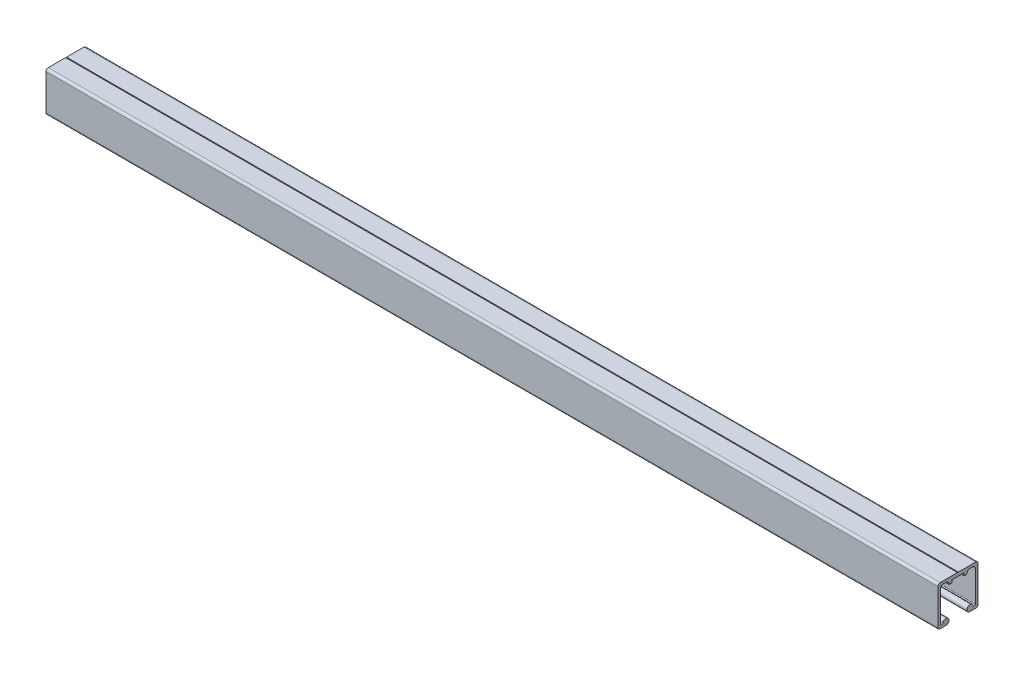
ISO-10303-21;
HEADER;
FILE_DESCRIPTION(('STEP AP214'),'2;1');
FILE_NAME('part.step','',(''),(''),'','','');
FILE_SCHEMA(('AUTOMOTIVE_DESIGN { 1 0 10303 214 1 1 1 1 }'));
ENDSEC;
DATA;
#1=APPLICATION_CONTEXT('core data for automotive mechanical design processes');
#2=APPLICATION_PROTOCOL_DEFINITION('international standard','automotive_design',2000,#1);
#3=PRODUCT_CONTEXT('',#1,'mechanical');
#4=PRODUCT('Part','Part','',(#3));
#5=PRODUCT_RELATED_PRODUCT_CATEGORY('part','',(#4));
#6=PRODUCT_DEFINITION_FORMATION('','',#4);
#7=PRODUCT_DEFINITION_CONTEXT('part definition',#1,'design');
#8=PRODUCT_DEFINITION('design','',#6,#7);
#9=PRODUCT_DEFINITION_SHAPE('','',#8);
#10=(LENGTH_UNIT() NAMED_UNIT(*) SI_UNIT(.MILLI.,.METRE.));
#11=(NAMED_UNIT(*) PLANE_ANGLE_UNIT() SI_UNIT($,.RADIAN.));
#12=(NAMED_UNIT(*) SI_UNIT($,.STERADIAN.) SOLID_ANGLE_UNIT());
#13=UNCERTAINTY_MEASURE_WITH_UNIT(LENGTH_MEASURE(1.E-05),#10,'distance_accuracy_value','');
#14=(GEOMETRIC_REPRESENTATION_CONTEXT(3) GLOBAL_UNCERTAINTY_ASSIGNED_CONTEXT((#13)) GLOBAL_UNIT_ASSIGNED_CONTEXT((#10,
#11,#12)) REPRESENTATION_CONTEXT('',''));
#15=CARTESIAN_POINT('',(0.,0.,0.));
#16=DIRECTION('',(0.,0.,1.));
#17=DIRECTION('',(1.,0.,0.));
#18=AXIS2_PLACEMENT_3D('',#15,#16,#17);
#19=CARTESIAN_POINT('',(1000.,16.5663300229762,-16.5000000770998));
#20=DIRECTION('',(-1.,0.,0.));
#21=DIRECTION('',(0.,0.,1.));
#22=AXIS2_PLACEMENT_3D('',#19,#20,#21);
#23=CYLINDRICAL_SURFACE('',#22,2.99999999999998);
#24=CARTESIAN_POINT('',(0.,16.5663300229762,-16.5000000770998));
#25=DIRECTION('',(-1.,0.,0.));
#26=DIRECTION('',(0.,0.,-1.));
#27=AXIS2_PLACEMENT_3D('',#24,#25,#26);
#28=CIRCLE('',#27,2.99999999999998);
#29=CARTESIAN_POINT('',(0.,19.5663300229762,-16.5000000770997));
#30=VERTEX_POINT('',#29);
#31=CARTESIAN_POINT('',(0.,16.5663300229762,-19.5000000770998));
#32=VERTEX_POINT('',#31);
#33=EDGE_CURVE('E419',#30,#32,#28,.T.);
#34=ORIENTED_EDGE('',*,*,#33,.T.);
#35=DIRECTION('',(-1.,0.,0.));
#36=VECTOR('',#35,1.);
#37=CARTESIAN_POINT('',(1000.,16.5663300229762,-19.5000000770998));
#38=LINE('',#37,#36);
#39=CARTESIAN_POINT('',(1000.,16.5663300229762,-19.5000000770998));
#40=VERTEX_POINT('',#39);
#41=EDGE_CURVE('E12',#40,#32,#38,.T.);
#42=ORIENTED_EDGE('',*,*,#41,.F.);
#43=CARTESIAN_POINT('',(1000.,16.5663300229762,-16.5000000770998));
#44=DIRECTION('',(-1.,0.,0.));
#45=DIRECTION('',(0.,0.,-1.));
#46=AXIS2_PLACEMENT_3D('',#43,#44,#45);
#47=CIRCLE('',#46,2.99999999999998);
#48=CARTESIAN_POINT('',(1000.,19.5663300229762,-16.5000000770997));
#49=VERTEX_POINT('',#48);
#50=EDGE_CURVE('E522',#49,#40,#47,.T.);
#51=ORIENTED_EDGE('',*,*,#50,.F.);
#52=DIRECTION('',(-1.,0.,0.));
#53=VECTOR('',#52,1.);
#54=CARTESIAN_POINT('',(1000.,19.5663300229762,-16.5000000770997));
#55=LINE('',#54,#53);
#56=EDGE_CURVE('E415',#49,#30,#55,.T.);
#57=ORIENTED_EDGE('',*,*,#56,.T.);
#58=EDGE_LOOP('',(#34,#42,#51,#57));
#59=FACE_BOUND('',#58,.T.);
#60=ADVANCED_FACE('F156',(#59),#23,.F.);
#61=CARTESIAN_POINT('',(1000.,16.5663300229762,-19.5000000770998));
#62=DIRECTION('',(0.,0.,-1.));
#63=DIRECTION('',(0.,1.,0.));
#64=AXIS2_PLACEMENT_3D('',#61,#62,#63);
#65=PLANE('',#64);
#66=DIRECTION('',(0.,-1.,0.));
#67=VECTOR('',#66,1.);
#68=CARTESIAN_POINT('',(0.,16.5663300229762,-19.5000000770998));
#69=LINE('',#68,#67);
#70=CARTESIAN_POINT('',(0.,-18.1836699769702,-19.5000000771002));
#71=VERTEX_POINT('',#70);
#72=EDGE_CURVE('E423',#32,#71,#69,.T.);
#73=ORIENTED_EDGE('',*,*,#72,.T.);
#74=DIRECTION('',(-1.,0.,0.));
#75=VECTOR('',#74,1.);
#76=CARTESIAN_POINT('',(1000.,-18.1836699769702,-19.5000000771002));
#77=LINE('',#76,#75);
#78=CARTESIAN_POINT('',(1000.,-18.1836699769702,-19.5000000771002));
#79=VERTEX_POINT('',#78);
#80=EDGE_CURVE('E165',#79,#71,#77,.T.);
#81=ORIENTED_EDGE('',*,*,#80,.F.);
#82=DIRECTION('',(0.,-1.,0.));
#83=VECTOR('',#82,1.);
#84=CARTESIAN_POINT('',(1000.,16.5663300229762,-19.5000000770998));
#85=LINE('',#84,#83);
#86=EDGE_CURVE('E297',#40,#79,#85,.T.);
#87=ORIENTED_EDGE('',*,*,#86,.F.);
#88=ORIENTED_EDGE('',*,*,#41,.T.);
#89=EDGE_LOOP('',(#73,#81,#87,#88));
#90=FACE_BOUND('',#89,.T.);
#91=ADVANCED_FACE('F777',(#90),#65,.F.);
#92=CARTESIAN_POINT('',(1000.,-18.1836699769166,-18.2500000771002));
#93=DIRECTION('',(-1.,0.,0.));
#94=DIRECTION('',(0.,0.,1.));
#95=AXIS2_PLACEMENT_3D('',#92,#93,#94);
#96=CYLINDRICAL_SURFACE('',#95,1.25000000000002);
#97=CARTESIAN_POINT('',(0.,-18.1836699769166,-18.2500000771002));
#98=DIRECTION('',(-1.,0.,0.));
#99=DIRECTION('',(0.,0.,-1.));
#100=AXIS2_PLACEMENT_3D('',#97,#98,#99);
#101=CIRCLE('',#100,1.25000000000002);
#102=CARTESIAN_POINT('',(0.,-18.5688052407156,-17.0608109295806));
#103=VERTEX_POINT('',#102);
#104=EDGE_CURVE('E426',#71,#103,#101,.T.);
#105=ORIENTED_EDGE('',*,*,#104,.T.);
#106=DIRECTION('',(-1.,0.,0.));
#107=VECTOR('',#106,1.);
#108=CARTESIAN_POINT('',(1000.,-18.5688052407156,-17.0608109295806));
#109=LINE('',#108,#107);
#110=CARTESIAN_POINT('',(1000.,-18.5688052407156,-17.0608109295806));
#111=VERTEX_POINT('',#110);
#112=EDGE_CURVE('E641',#111,#103,#109,.T.);
#113=ORIENTED_EDGE('',*,*,#112,.F.);
#114=CARTESIAN_POINT('',(1000.,-18.1836699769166,-18.2500000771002));
#115=DIRECTION('',(-1.,0.,0.));
#116=DIRECTION('',(0.,0.,-1.));
#117=AXIS2_PLACEMENT_3D('',#114,#115,#116);
#118=CIRCLE('',#117,1.25000000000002);
#119=EDGE_CURVE('E651',#79,#111,#118,.T.);
#120=ORIENTED_EDGE('',*,*,#119,.F.);
#121=ORIENTED_EDGE('',*,*,#80,.T.);
#122=EDGE_LOOP('',(#105,#113,#120,#121));
#123=FACE_BOUND('',#122,.T.);
#124=ADVANCED_FACE('F649',(#123),#96,.F.);
#125=CARTESIAN_POINT('',(1000.,-18.5688052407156,-17.0608109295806));
#126=DIRECTION('',(0.,-0.308108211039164,0.951351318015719));
#127=DIRECTION('',(0.,-0.951351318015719,-0.308108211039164));
#128=AXIS2_PLACEMENT_3D('',#125,#126,#127);
#129=PLANE('',#128);
#130=DIRECTION('',(0.,0.951351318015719,0.308108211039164));
#131=VECTOR('',#130,1.);
#132=CARTESIAN_POINT('',(0.,-18.5688052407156,-17.0608109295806));
#133=LINE('',#132,#131);
#134=CARTESIAN_POINT('',(0.,-17.8552912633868,-16.8297296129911));
#135=VERTEX_POINT('',#134);
#136=EDGE_CURVE('E429',#103,#135,#133,.T.);
#137=ORIENTED_EDGE('',*,*,#136,.T.);
#138=DIRECTION('',(-1.,0.,0.));
#139=VECTOR('',#138,1.);
#140=CARTESIAN_POINT('',(1000.,-17.8552912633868,-16.8297296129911));
#141=LINE('',#140,#139);
#142=CARTESIAN_POINT('',(1000.,-17.8552912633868,-16.8297296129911));
#143=VERTEX_POINT('',#142);
#144=EDGE_CURVE('E637',#143,#135,#141,.T.);
#145=ORIENTED_EDGE('',*,*,#144,.F.);
#146=DIRECTION('',(0.,0.951351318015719,0.308108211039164));
#147=VECTOR('',#146,1.);
#148=CARTESIAN_POINT('',(1000.,-18.5688052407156,-17.0608109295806));
#149=LINE('',#148,#147);
#150=EDGE_CURVE('E670',#111,#143,#149,.T.);
#151=ORIENTED_EDGE('',*,*,#150,.F.);
#152=ORIENTED_EDGE('',*,*,#112,.T.);
#153=EDGE_LOOP('',(#137,#145,#151,#152));
#154=FACE_BOUND('',#153,.T.);
#155=ADVANCED_FACE('F660',(#154),#129,.F.);
#156=CARTESIAN_POINT('',(1000.,-18.9336700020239,-13.499999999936));
#157=DIRECTION('',(-1.,0.,0.));
#158=DIRECTION('',(0.,0.,1.));
#159=AXIS2_PLACEMENT_3D('',#156,#157,#158);
#160=CYLINDRICAL_SURFACE('',#159,3.50000000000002);
#161=CARTESIAN_POINT('',(0.,-18.9336700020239,-13.499999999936));
#162=DIRECTION('',(1.,0.,0.));
#163=DIRECTION('',(0.,0.,-1.));
#164=AXIS2_PLACEMENT_3D('',#161,#162,#163);
#165=CIRCLE('',#164,3.50000000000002);
#166=CARTESIAN_POINT('',(0.,-22.4336700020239,-13.4999999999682));
#167=VERTEX_POINT('',#166);
#168=EDGE_CURVE('E432',#135,#167,#165,.T.);
#169=ORIENTED_EDGE('',*,*,#168,.T.);
#170=DIRECTION('',(-1.,0.,0.));
#171=VECTOR('',#170,1.);
#172=CARTESIAN_POINT('',(1000.,-22.4336700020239,-13.4999999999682));
#173=LINE('',#172,#171);
#174=CARTESIAN_POINT('',(1000.,-22.4336700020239,-13.4999999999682));
#175=VERTEX_POINT('',#174);
#176=EDGE_CURVE('E633',#175,#167,#173,.T.);
#177=ORIENTED_EDGE('',*,*,#176,.F.);
#178=CARTESIAN_POINT('',(1000.,-18.9336700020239,-13.499999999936));
#179=DIRECTION('',(1.,0.,0.));
#180=DIRECTION('',(0.,0.,-1.));
#181=AXIS2_PLACEMENT_3D('',#178,#179,#180);
#182=CIRCLE('',#181,3.50000000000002);
#183=EDGE_CURVE('E666',#143,#175,#182,.T.);
#184=ORIENTED_EDGE('',*,*,#183,.F.);
#185=ORIENTED_EDGE('',*,*,#144,.T.);
#186=EDGE_LOOP('',(#169,#177,#184,#185));
#187=FACE_BOUND('',#186,.T.);
#188=ADVANCED_FACE('F664',(#187),#160,.T.);
#189=CARTESIAN_POINT('',(1000.,-22.4336700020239,-13.4999999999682));
#190=DIRECTION('',(0.,1.,0.));
#191=DIRECTION('',(0.,0.,1.));
#192=AXIS2_PLACEMENT_3D('',#189,#190,#191);
#193=PLANE('',#192);
#194=DIRECTION('',(0.,0.,-1.));
#195=VECTOR('',#194,1.);
#196=CARTESIAN_POINT('',(0.,-22.4336700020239,-13.4999999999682));
#197=LINE('',#196,#195);
#198=CARTESIAN_POINT('',(0.,-22.4336700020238,-20.0000000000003));
#199=VERTEX_POINT('',#198);
#200=EDGE_CURVE('E435',#167,#199,#197,.T.);
#201=ORIENTED_EDGE('',*,*,#200,.T.);
#202=DIRECTION('',(-1.,0.,0.));
#203=VECTOR('',#202,1.);
#204=CARTESIAN_POINT('',(1000.,-22.4336700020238,-20.0000000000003));
#205=LINE('',#204,#203);
#206=CARTESIAN_POINT('',(1000.,-22.4336700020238,-20.0000000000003));
#207=VERTEX_POINT('',#206);
#208=EDGE_CURVE('E629',#207,#199,#205,.T.);
#209=ORIENTED_EDGE('',*,*,#208,.F.);
#210=DIRECTION('',(0.,0.,-1.));
#211=VECTOR('',#210,1.);
#212=CARTESIAN_POINT('',(1000.,-22.4336700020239,-13.4999999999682));
#213=LINE('',#212,#211);
#214=EDGE_CURVE('E669',#175,#207,#213,.T.);
#215=ORIENTED_EDGE('',*,*,#214,.F.);
#216=ORIENTED_EDGE('',*,*,#176,.T.);
#217=EDGE_LOOP('',(#201,#209,#215,#216));
#218=FACE_BOUND('',#217,.T.);
#219=ADVANCED_FACE('F790',(#218),#193,.F.);
#220=CARTESIAN_POINT('',(1000.,-19.9336700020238,-20.0000000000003));
#221=DIRECTION('',(-1.,0.,0.));
#222=DIRECTION('',(0.,0.,1.));
#223=AXIS2_PLACEMENT_3D('',#220,#221,#222);
#224=CYLINDRICAL_SURFACE('',#223,2.50000000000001);
#225=CARTESIAN_POINT('',(0.,-19.9336700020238,-20.0000000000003));
#226=DIRECTION('',(1.,0.,0.));
#227=DIRECTION('',(0.,0.,-1.));
#228=AXIS2_PLACEMENT_3D('',#225,#226,#227);
#229=CIRCLE('',#228,2.50000000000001);
#230=CARTESIAN_POINT('',(0.,-19.9336700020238,-22.5000000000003));
#231=VERTEX_POINT('',#230);
#232=EDGE_CURVE('E438',#199,#231,#229,.T.);
#233=ORIENTED_EDGE('',*,*,#232,.T.);
#234=DIRECTION('',(-1.,0.,0.));
#235=VECTOR('',#234,1.);
#236=CARTESIAN_POINT('',(1000.,-19.9336700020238,-22.5000000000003));
#237=LINE('',#236,#235);
#238=CARTESIAN_POINT('',(1000.,-19.9336700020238,-22.5000000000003));
#239=VERTEX_POINT('',#238);
#240=EDGE_CURVE('E625',#239,#231,#237,.T.);
#241=ORIENTED_EDGE('',*,*,#240,.F.);
#242=CARTESIAN_POINT('',(1000.,-19.9336700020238,-20.0000000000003));
#243=DIRECTION('',(1.,0.,0.));
#244=DIRECTION('',(0.,0.,-1.));
#245=AXIS2_PLACEMENT_3D('',#242,#243,#244);
#246=CIRCLE('',#245,2.50000000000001);
#247=EDGE_CURVE('E674',#207,#239,#246,.T.);
#248=ORIENTED_EDGE('',*,*,#247,.F.);
#249=ORIENTED_EDGE('',*,*,#208,.T.);
#250=EDGE_LOOP('',(#233,#241,#248,#249));
#251=FACE_BOUND('',#250,.T.);
#252=ADVANCED_FACE('F793',(#251),#224,.T.);
#253=CARTESIAN_POINT('',(1000.,-19.9336700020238,-22.5000000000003));
#254=DIRECTION('',(0.,0.,1.));
#255=DIRECTION('',(0.,-1.,0.));
#256=AXIS2_PLACEMENT_3D('',#253,#254,#255);
#257=PLANE('',#256);
#258=DIRECTION('',(0.,1.,0.));
#259=VECTOR('',#258,1.);
#260=CARTESIAN_POINT('',(0.,-19.9336700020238,-22.5000000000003));
#261=LINE('',#260,#259);
#262=CARTESIAN_POINT('',(0.,20.0663299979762,-22.4999999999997));
#263=VERTEX_POINT('',#262);
#264=EDGE_CURVE('E441',#231,#263,#261,.T.);
#265=ORIENTED_EDGE('',*,*,#264,.T.);
#266=DIRECTION('',(-1.,0.,0.));
#267=VECTOR('',#266,1.);
#268=CARTESIAN_POINT('',(1000.,20.0663299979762,-22.4999999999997));
#269=LINE('',#268,#267);
#270=CARTESIAN_POINT('',(1000.,20.0663299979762,-22.4999999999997));
#271=VERTEX_POINT('',#270);
#272=EDGE_CURVE('E621',#271,#263,#269,.T.);
#273=ORIENTED_EDGE('',*,*,#272,.F.);
#274=DIRECTION('',(0.,1.,0.));
#275=VECTOR('',#274,1.);
#276=CARTESIAN_POINT('',(1000.,-19.9336700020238,-22.5000000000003));
#277=LINE('',#276,#275);
#278=EDGE_CURVE('E681',#239,#271,#277,.T.);
#279=ORIENTED_EDGE('',*,*,#278,.F.);
#280=ORIENTED_EDGE('',*,*,#240,.T.);
#281=EDGE_LOOP('',(#265,#273,#279,#280));
#282=FACE_BOUND('',#281,.T.);
#283=ADVANCED_FACE('F797',(#282),#257,.F.);
#284=CARTESIAN_POINT('',(1000.,20.0663299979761,-19.9999999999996));
#285=DIRECTION('',(-1.,0.,0.));
#286=DIRECTION('',(0.,0.,1.));
#287=AXIS2_PLACEMENT_3D('',#284,#285,#286);
#288=CYLINDRICAL_SURFACE('',#287,2.50000000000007);
#289=CARTESIAN_POINT('',(0.,20.0663299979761,-19.9999999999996));
#290=DIRECTION('',(1.,0.,0.));
#291=DIRECTION('',(0.,0.,-1.));
#292=AXIS2_PLACEMENT_3D('',#289,#290,#291);
#293=CIRCLE('',#292,2.50000000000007);
#294=CARTESIAN_POINT('',(0.,22.5663299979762,-19.9999999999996));
#295=VERTEX_POINT('',#294);
#296=EDGE_CURVE('E444',#263,#295,#293,.T.);
#297=ORIENTED_EDGE('',*,*,#296,.T.);
#298=DIRECTION('',(-1.,0.,0.));
#299=VECTOR('',#298,1.);
#300=CARTESIAN_POINT('',(1000.,22.5663299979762,-19.9999999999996));
#301=LINE('',#300,#299);
#302=CARTESIAN_POINT('',(1000.,22.5663299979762,-19.9999999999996));
#303=VERTEX_POINT('',#302);
#304=EDGE_CURVE('E617',#303,#295,#301,.T.);
#305=ORIENTED_EDGE('',*,*,#304,.F.);
#306=CARTESIAN_POINT('',(1000.,20.0663299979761,-19.9999999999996));
#307=DIRECTION('',(1.,0.,0.));
#308=DIRECTION('',(0.,0.,-1.));
#309=AXIS2_PLACEMENT_3D('',#306,#307,#308);
#310=CIRCLE('',#309,2.50000000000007);
#311=EDGE_CURVE('E684',#271,#303,#310,.T.);
#312=ORIENTED_EDGE('',*,*,#311,.F.);
#313=ORIENTED_EDGE('',*,*,#272,.T.);
#314=EDGE_LOOP('',(#297,#305,#312,#313));
#315=FACE_BOUND('',#314,.T.);
#316=ADVANCED_FACE('F801',(#315),#288,.T.);
#317=CARTESIAN_POINT('',(1000.,22.5663299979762,-19.9999999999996));
#318=DIRECTION('',(0.,-1.,0.));
#319=DIRECTION('',(0.,0.,-1.));
#320=AXIS2_PLACEMENT_3D('',#317,#318,#319);
#321=PLANE('',#320);
#322=DIRECTION('',(0.,0.,1.));
#323=VECTOR('',#322,1.);
#324=CARTESIAN_POINT('',(0.,22.5663299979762,-19.9999999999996));
#325=LINE('',#324,#323);
#326=CARTESIAN_POINT('',(0.,22.5663299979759,-0.500000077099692));
#327=VERTEX_POINT('',#326);
#328=EDGE_CURVE('E447',#295,#327,#325,.T.);
#329=ORIENTED_EDGE('',*,*,#328,.T.);
#330=DIRECTION('',(-1.,0.,0.));
#331=VECTOR('',#330,1.);
#332=CARTESIAN_POINT('',(1000.,22.5663299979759,-0.500000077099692));
#333=LINE('',#332,#331);
#334=CARTESIAN_POINT('',(1000.,22.5663299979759,-0.500000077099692));
#335=VERTEX_POINT('',#334);
#336=EDGE_CURVE('E613',#335,#327,#333,.T.);
#337=ORIENTED_EDGE('',*,*,#336,.F.);
#338=DIRECTION('',(0.,0.,1.));
#339=VECTOR('',#338,1.);
#340=CARTESIAN_POINT('',(1000.,22.5663299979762,-19.9999999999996));
#341=LINE('',#340,#339);
#342=EDGE_CURVE('E687',#303,#335,#341,.T.);
#343=ORIENTED_EDGE('',*,*,#342,.F.);
#344=ORIENTED_EDGE('',*,*,#304,.T.);
#345=EDGE_LOOP('',(#329,#337,#343,#344));
#346=FACE_BOUND('',#345,.T.);
#347=ADVANCED_FACE('F805',(#346),#321,.F.);
#348=CARTESIAN_POINT('',(1000.,22.5663299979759,-0.500000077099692));
#349=DIRECTION('',(0.,-0.707106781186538,-0.707106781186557));
#350=DIRECTION('',(0.,0.707106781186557,-0.707106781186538));
#351=AXIS2_PLACEMENT_3D('',#348,#349,#350);
#352=PLANE('',#351);
#353=DIRECTION('',(0.,-0.707106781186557,0.707106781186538));
#354=VECTOR('',#353,1.);
#355=CARTESIAN_POINT('',(0.,22.5663299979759,-0.500000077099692));
#356=LINE('',#355,#354);
#357=CARTESIAN_POINT('',(0.,22.0663299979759,-7.70996983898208E-08));
#358=VERTEX_POINT('',#357);
#359=EDGE_CURVE('E450',#327,#358,#356,.T.);
#360=ORIENTED_EDGE('',*,*,#359,.T.);
#361=DIRECTION('',(-1.,0.,0.));
#362=VECTOR('',#361,1.);
#363=CARTESIAN_POINT('',(1000.,22.0663299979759,-7.70996983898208E-08));
#364=LINE('',#363,#362);
#365=CARTESIAN_POINT('',(1000.,22.0663299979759,-7.70996983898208E-08));
#366=VERTEX_POINT('',#365);
#367=EDGE_CURVE('E609',#366,#358,#364,.T.);
#368=ORIENTED_EDGE('',*,*,#367,.F.);
#369=DIRECTION('',(0.,-0.707106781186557,0.707106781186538));
#370=VECTOR('',#369,1.);
#371=CARTESIAN_POINT('',(1000.,22.5663299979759,-0.500000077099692));
#372=LINE('',#371,#370);
#373=EDGE_CURVE('E690',#335,#366,#372,.T.);
#374=ORIENTED_EDGE('',*,*,#373,.F.);
#375=ORIENTED_EDGE('',*,*,#336,.T.);
#376=EDGE_LOOP('',(#360,#368,#374,#375));
#377=FACE_BOUND('',#376,.T.);
#378=ADVANCED_FACE('F809',(#377),#352,.F.);
#379=CARTESIAN_POINT('',(1000.,22.0663299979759,-7.70996983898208E-08));
#380=DIRECTION('',(0.,-0.707106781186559,0.707106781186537));
#381=DIRECTION('',(0.,-0.707106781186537,-0.707106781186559));
#382=AXIS2_PLACEMENT_3D('',#379,#380,#381);
#383=PLANE('',#382);
#384=DIRECTION('',(0.,0.707106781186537,0.707106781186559));
#385=VECTOR('',#384,1.);
#386=CARTESIAN_POINT('',(0.,22.0663299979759,-7.70996983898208E-08));
#387=LINE('',#386,#385);
#388=CARTESIAN_POINT('',(0.,22.5663299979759,0.499999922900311));
#389=VERTEX_POINT('',#388);
#390=EDGE_CURVE('E453',#358,#389,#387,.T.);
#391=ORIENTED_EDGE('',*,*,#390,.T.);
#392=DIRECTION('',(-1.,0.,0.));
#393=VECTOR('',#392,1.);
#394=CARTESIAN_POINT('',(1000.,22.5663299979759,0.499999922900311));
#395=LINE('',#394,#393);
#396=CARTESIAN_POINT('',(1000.,22.5663299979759,0.499999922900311));
#397=VERTEX_POINT('',#396);
#398=EDGE_CURVE('E605',#397,#389,#395,.T.);
#399=ORIENTED_EDGE('',*,*,#398,.F.);
#400=DIRECTION('',(0.,0.707106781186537,0.707106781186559));
#401=VECTOR('',#400,1.);
#402=CARTESIAN_POINT('',(1000.,22.0663299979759,-7.70996983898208E-08));
#403=LINE('',#402,#401);
#404=EDGE_CURVE('E693',#366,#397,#403,.T.);
#405=ORIENTED_EDGE('',*,*,#404,.F.);
#406=ORIENTED_EDGE('',*,*,#367,.T.);
#407=EDGE_LOOP('',(#391,#399,#405,#406));
#408=FACE_BOUND('',#407,.T.);
#409=ADVANCED_FACE('F813',(#408),#383,.F.);
#410=CARTESIAN_POINT('',(1000.,22.5663299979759,0.499999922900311));
#411=DIRECTION('',(0.,-1.,0.));
#412=DIRECTION('',(0.,0.,-1.));
#413=AXIS2_PLACEMENT_3D('',#410,#411,#412);
#414=PLANE('',#413);
#415=DIRECTION('',(0.,0.,1.));
#416=VECTOR('',#415,1.);
#417=CARTESIAN_POINT('',(0.,22.5663299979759,0.499999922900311));
#418=LINE('',#417,#416);
#419=CARTESIAN_POINT('',(0.,22.5663299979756,20.0000000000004));
#420=VERTEX_POINT('',#419);
#421=EDGE_CURVE('E456',#389,#420,#418,.T.);
#422=ORIENTED_EDGE('',*,*,#421,.T.);
#423=DIRECTION('',(-1.,0.,0.));
#424=VECTOR('',#423,1.);
#425=CARTESIAN_POINT('',(1000.,22.5663299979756,20.0000000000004));
#426=LINE('',#425,#424);
#427=CARTESIAN_POINT('',(1000.,22.5663299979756,20.0000000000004));
#428=VERTEX_POINT('',#427);
#429=EDGE_CURVE('E601',#428,#420,#426,.T.);
#430=ORIENTED_EDGE('',*,*,#429,.F.);
#431=DIRECTION('',(0.,0.,1.));
#432=VECTOR('',#431,1.);
#433=CARTESIAN_POINT('',(1000.,22.5663299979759,0.499999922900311));
#434=LINE('',#433,#432);
#435=EDGE_CURVE('E696',#397,#428,#434,.T.);
#436=ORIENTED_EDGE('',*,*,#435,.F.);
#437=ORIENTED_EDGE('',*,*,#398,.T.);
#438=EDGE_LOOP('',(#422,#430,#436,#437));
#439=FACE_BOUND('',#438,.T.);
#440=ADVANCED_FACE('F817',(#439),#414,.F.);
#441=CARTESIAN_POINT('',(1000.,20.0663299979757,20.0000000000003));
#442=DIRECTION('',(-1.,0.,0.));
#443=DIRECTION('',(0.,0.,1.));
#444=AXIS2_PLACEMENT_3D('',#441,#442,#443);
#445=CYLINDRICAL_SURFACE('',#444,2.49999999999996);
#446=CARTESIAN_POINT('',(0.,20.0663299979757,20.0000000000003));
#447=DIRECTION('',(1.,0.,0.));
#448=DIRECTION('',(0.,0.,-1.));
#449=AXIS2_PLACEMENT_3D('',#446,#447,#448);
#450=CIRCLE('',#449,2.49999999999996);
#451=CARTESIAN_POINT('',(0.,20.0663299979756,22.5000000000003));
#452=VERTEX_POINT('',#451);
#453=EDGE_CURVE('E459',#420,#452,#450,.T.);
#454=ORIENTED_EDGE('',*,*,#453,.T.);
#455=DIRECTION('',(-1.,0.,0.));
#456=VECTOR('',#455,1.);
#457=CARTESIAN_POINT('',(1000.,20.0663299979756,22.5000000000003));
#458=LINE('',#457,#456);
#459=CARTESIAN_POINT('',(1000.,20.0663299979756,22.5000000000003));
#460=VERTEX_POINT('',#459);
#461=EDGE_CURVE('E597',#460,#452,#458,.T.);
#462=ORIENTED_EDGE('',*,*,#461,.F.);
#463=CARTESIAN_POINT('',(1000.,20.0663299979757,20.0000000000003));
#464=DIRECTION('',(1.,0.,0.));
#465=DIRECTION('',(0.,0.,-1.));
#466=AXIS2_PLACEMENT_3D('',#463,#464,#465);
#467=CIRCLE('',#466,2.49999999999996);
#468=EDGE_CURVE('E699',#428,#460,#467,.T.);
#469=ORIENTED_EDGE('',*,*,#468,.F.);
#470=ORIENTED_EDGE('',*,*,#429,.T.);
#471=EDGE_LOOP('',(#454,#462,#469,#470));
#472=FACE_BOUND('',#471,.T.);
#473=ADVANCED_FACE('F821',(#472),#445,.T.);
#474=CARTESIAN_POINT('',(1000.,20.0663299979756,22.5000000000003));
#475=DIRECTION('',(0.,0.,-1.));
#476=DIRECTION('',(0.,1.,0.));
#477=AXIS2_PLACEMENT_3D('',#474,#475,#476);
#478=PLANE('',#477);
#479=DIRECTION('',(0.,-1.,0.));
#480=VECTOR('',#479,1.);
#481=CARTESIAN_POINT('',(0.,20.0663299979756,22.5000000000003));
#482=LINE('',#481,#480);
#483=CARTESIAN_POINT('',(0.,-19.9336700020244,22.4999999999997));
#484=VERTEX_POINT('',#483);
#485=EDGE_CURVE('E462',#452,#484,#482,.T.);
#486=ORIENTED_EDGE('',*,*,#485,.T.);
#487=DIRECTION('',(-1.,0.,0.));
#488=VECTOR('',#487,1.);
#489=CARTESIAN_POINT('',(1000.,-19.9336700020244,22.4999999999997));
#490=LINE('',#489,#488);
#491=CARTESIAN_POINT('',(1000.,-19.9336700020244,22.4999999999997));
#492=VERTEX_POINT('',#491);
#493=EDGE_CURVE('E593',#492,#484,#490,.T.);
#494=ORIENTED_EDGE('',*,*,#493,.F.);
#495=DIRECTION('',(0.,-1.,0.));
#496=VECTOR('',#495,1.);
#497=CARTESIAN_POINT('',(1000.,20.0663299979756,22.5000000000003));
#498=LINE('',#497,#496);
#499=EDGE_CURVE('E702',#460,#492,#498,.T.);
#500=ORIENTED_EDGE('',*,*,#499,.F.);
#501=ORIENTED_EDGE('',*,*,#461,.T.);
#502=EDGE_LOOP('',(#486,#494,#500,#501));
#503=FACE_BOUND('',#502,.T.);
#504=ADVANCED_FACE('F825',(#503),#478,.F.);
#505=CARTESIAN_POINT('',(1000.,-19.9336700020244,19.9999999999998));
#506=DIRECTION('',(-1.,0.,0.));
#507=DIRECTION('',(0.,0.,1.));
#508=AXIS2_PLACEMENT_3D('',#505,#506,#507);
#509=CYLINDRICAL_SURFACE('',#508,2.49999999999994);
#510=CARTESIAN_POINT('',(0.,-19.9336700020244,19.9999999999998));
#511=DIRECTION('',(1.,0.,0.));
#512=DIRECTION('',(0.,0.,-1.));
#513=AXIS2_PLACEMENT_3D('',#510,#511,#512);
#514=CIRCLE('',#513,2.49999999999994);
#515=CARTESIAN_POINT('',(0.,-22.4336700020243,19.9999999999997));
#516=VERTEX_POINT('',#515);
#517=EDGE_CURVE('E465',#484,#516,#514,.T.);
#518=ORIENTED_EDGE('',*,*,#517,.T.);
#519=DIRECTION('',(-1.,0.,0.));
#520=VECTOR('',#519,1.);
#521=CARTESIAN_POINT('',(1000.,-22.4336700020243,19.9999999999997));
#522=LINE('',#521,#520);
#523=CARTESIAN_POINT('',(1000.,-22.4336700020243,19.9999999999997));
#524=VERTEX_POINT('',#523);
#525=EDGE_CURVE('E589',#524,#516,#522,.T.);
#526=ORIENTED_EDGE('',*,*,#525,.F.);
#527=CARTESIAN_POINT('',(1000.,-19.9336700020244,19.9999999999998));
#528=DIRECTION('',(1.,0.,0.));
#529=DIRECTION('',(0.,0.,-1.));
#530=AXIS2_PLACEMENT_3D('',#527,#528,#529);
#531=CIRCLE('',#530,2.49999999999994);
#532=EDGE_CURVE('E705',#492,#524,#531,.T.);
#533=ORIENTED_EDGE('',*,*,#532,.F.);
#534=ORIENTED_EDGE('',*,*,#493,.T.);
#535=EDGE_LOOP('',(#518,#526,#533,#534));
#536=FACE_BOUND('',#535,.T.);
#537=ADVANCED_FACE('F829',(#536),#509,.T.);
#538=CARTESIAN_POINT('',(1000.,-22.4336700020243,19.9999999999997));
#539=DIRECTION('',(0.,1.,0.));
#540=DIRECTION('',(0.,0.,1.));
#541=AXIS2_PLACEMENT_3D('',#538,#539,#540);
#542=PLANE('',#541);
#543=DIRECTION('',(0.,0.,-1.));
#544=VECTOR('',#543,1.);
#545=CARTESIAN_POINT('',(0.,-22.4336700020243,19.9999999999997));
#546=LINE('',#545,#544);
#547=CARTESIAN_POINT('',(0.,-22.4336700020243,13.500000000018));
#548=VERTEX_POINT('',#547);
#549=EDGE_CURVE('E468',#516,#548,#546,.T.);
#550=ORIENTED_EDGE('',*,*,#549,.T.);
#551=DIRECTION('',(-1.,0.,0.));
#552=VECTOR('',#551,1.);
#553=CARTESIAN_POINT('',(1000.,-22.4336700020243,13.500000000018));
#554=LINE('',#553,#552);
#555=CARTESIAN_POINT('',(1000.,-22.4336700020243,13.500000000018));
#556=VERTEX_POINT('',#555);
#557=EDGE_CURVE('E585',#556,#548,#554,.T.);
#558=ORIENTED_EDGE('',*,*,#557,.F.);
#559=DIRECTION('',(0.,0.,-1.));
#560=VECTOR('',#559,1.);
#561=CARTESIAN_POINT('',(1000.,-22.4336700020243,19.9999999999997));
#562=LINE('',#561,#560);
#563=EDGE_CURVE('E708',#524,#556,#562,.T.);
#564=ORIENTED_EDGE('',*,*,#563,.F.);
#565=ORIENTED_EDGE('',*,*,#525,.T.);
#566=EDGE_LOOP('',(#550,#558,#564,#565));
#567=FACE_BOUND('',#566,.T.);
#568=ADVANCED_FACE('F833',(#567),#542,.F.);
#569=CARTESIAN_POINT('',(1000.,-18.9336698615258,13.500000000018));
#570=DIRECTION('',(-1.,0.,0.));
#571=DIRECTION('',(0.,0.,1.));
#572=AXIS2_PLACEMENT_3D('',#569,#570,#571);
#573=CYLINDRICAL_SURFACE('',#572,3.50000014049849);
#574=CARTESIAN_POINT('',(0.,-18.9336698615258,13.500000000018));
#575=DIRECTION('',(1.,0.,0.));
#576=DIRECTION('',(0.,0.,-1.));
#577=AXIS2_PLACEMENT_3D('',#574,#575,#576);
#578=CIRCLE('',#577,3.50000014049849);
#579=CARTESIAN_POINT('',(0.,-17.8552954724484,16.8297311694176));
#580=VERTEX_POINT('',#579);
#581=EDGE_CURVE('E471',#548,#580,#578,.T.);
#582=ORIENTED_EDGE('',*,*,#581,.T.);
#583=DIRECTION('',(-1.,0.,0.));
#584=VECTOR('',#583,1.);
#585=CARTESIAN_POINT('',(1000.,-17.8552954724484,16.8297311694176));
#586=LINE('',#585,#584);
#587=CARTESIAN_POINT('',(1000.,-17.8552954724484,16.8297311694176));
#588=VERTEX_POINT('',#587);
#589=EDGE_CURVE('E581',#588,#580,#586,.T.);
#590=ORIENTED_EDGE('',*,*,#589,.F.);
#591=CARTESIAN_POINT('',(1000.,-18.9336698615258,13.500000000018));
#592=DIRECTION('',(1.,0.,0.));
#593=DIRECTION('',(0.,0.,-1.));
#594=AXIS2_PLACEMENT_3D('',#591,#592,#593);
#595=CIRCLE('',#594,3.50000014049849);
#596=EDGE_CURVE('E711',#556,#588,#595,.T.);
#597=ORIENTED_EDGE('',*,*,#596,.F.);
#598=ORIENTED_EDGE('',*,*,#557,.T.);
#599=EDGE_LOOP('',(#582,#590,#597,#598));
#600=FACE_BOUND('',#599,.T.);
#601=ADVANCED_FACE('F837',(#600),#573,.T.);
#602=CARTESIAN_POINT('',(1000.,-17.8552954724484,16.8297311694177));
#603=DIRECTION('',(0.,-0.30810579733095,-0.951352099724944));
#604=DIRECTION('',(0.,0.951352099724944,-0.30810579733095));
#605=AXIS2_PLACEMENT_3D('',#602,#603,#604);
#606=PLANE('',#605);
#607=DIRECTION('',(0.,-0.951352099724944,0.30810579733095));
#608=VECTOR('',#607,1.);
#609=CARTESIAN_POINT('',(0.,-17.8552954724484,16.8297311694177));
#610=LINE('',#609,#608);
#611=CARTESIAN_POINT('',(0.,-18.5688026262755,17.060808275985));
#612=VERTEX_POINT('',#611);
#613=EDGE_CURVE('E474',#580,#612,#610,.T.);
#614=ORIENTED_EDGE('',*,*,#613,.T.);
#615=DIRECTION('',(-1.,0.,0.));
#616=VECTOR('',#615,1.);
#617=CARTESIAN_POINT('',(1000.,-18.5688026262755,17.060808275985));
#618=LINE('',#617,#616);
#619=CARTESIAN_POINT('',(1000.,-18.5688026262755,17.060808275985));
#620=VERTEX_POINT('',#619);
#621=EDGE_CURVE('E577',#620,#612,#618,.T.);
#622=ORIENTED_EDGE('',*,*,#621,.F.);
#623=DIRECTION('',(0.,-0.951352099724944,0.30810579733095));
#624=VECTOR('',#623,1.);
#625=CARTESIAN_POINT('',(1000.,-17.8552954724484,16.8297311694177));
#626=LINE('',#625,#624);
#627=EDGE_CURVE('E714',#588,#620,#626,.T.);
#628=ORIENTED_EDGE('',*,*,#627,.F.);
#629=ORIENTED_EDGE('',*,*,#589,.T.);
#630=EDGE_LOOP('',(#614,#622,#628,#629));
#631=FACE_BOUND('',#630,.T.);
#632=ADVANCED_FACE('F841',(#631),#606,.F.);
#633=CARTESIAN_POINT('',(1000.,-18.1836704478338,18.2499981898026));
#634=DIRECTION('',(-1.,0.,0.));
#635=DIRECTION('',(0.,0.,1.));
#636=AXIS2_PLACEMENT_3D('',#633,#634,#635);
#637=CYLINDRICAL_SURFACE('',#636,1.24999977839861);
#638=CARTESIAN_POINT('',(0.,-18.1836704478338,18.2499981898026));
#639=DIRECTION('',(-1.,0.,0.));
#640=DIRECTION('',(0.,0.,-1.));
#641=AXIS2_PLACEMENT_3D('',#638,#639,#640);
#642=CIRCLE('',#641,1.24999977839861);
#643=CARTESIAN_POINT('',(0.,-18.1836704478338,19.4999979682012));
#644=VERTEX_POINT('',#643);
#645=EDGE_CURVE('E477',#612,#644,#642,.T.);
#646=ORIENTED_EDGE('',*,*,#645,.T.);
#647=DIRECTION('',(-1.,0.,0.));
#648=VECTOR('',#647,1.);
#649=CARTESIAN_POINT('',(1000.,-18.1836704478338,19.4999979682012));
#650=LINE('',#649,#648);
#651=CARTESIAN_POINT('',(1000.,-18.1836704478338,19.4999979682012));
#652=VERTEX_POINT('',#651);
#653=EDGE_CURVE('E573',#652,#644,#650,.T.);
#654=ORIENTED_EDGE('',*,*,#653,.F.);
#655=CARTESIAN_POINT('',(1000.,-18.1836704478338,18.2499981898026));
#656=DIRECTION('',(-1.,0.,0.));
#657=DIRECTION('',(0.,0.,-1.));
#658=AXIS2_PLACEMENT_3D('',#655,#656,#657);
#659=CIRCLE('',#658,1.24999977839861);
#660=EDGE_CURVE('E717',#620,#652,#659,.T.);
#661=ORIENTED_EDGE('',*,*,#660,.F.);
#662=ORIENTED_EDGE('',*,*,#621,.T.);
#663=EDGE_LOOP('',(#646,#654,#661,#662));
#664=FACE_BOUND('',#663,.T.);
#665=ADVANCED_FACE('F845',(#664),#637,.F.);
#666=CARTESIAN_POINT('',(1000.,-18.1836704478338,19.4999979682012));
#667=DIRECTION('',(0.,0.,1.));
#668=DIRECTION('',(0.,-1.,0.));
#669=AXIS2_PLACEMENT_3D('',#666,#667,#668);
#670=PLANE('',#669);
#671=DIRECTION('',(0.,1.,0.));
#672=VECTOR('',#671,1.);
#673=CARTESIAN_POINT('',(0.,-18.1836704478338,19.4999979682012));
#674=LINE('',#673,#672);
#675=CARTESIAN_POINT('',(0.,16.5663295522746,19.4999979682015));
#676=VERTEX_POINT('',#675);
#677=EDGE_CURVE('E480',#644,#676,#674,.T.);
#678=ORIENTED_EDGE('',*,*,#677,.T.);
#679=DIRECTION('',(-1.,0.,0.));
#680=VECTOR('',#679,1.);
#681=CARTESIAN_POINT('',(1000.,16.5663295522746,19.4999979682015));
#682=LINE('',#681,#680);
#683=CARTESIAN_POINT('',(1000.,16.5663295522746,19.4999979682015));
#684=VERTEX_POINT('',#683);
#685=EDGE_CURVE('E569',#684,#676,#682,.T.);
#686=ORIENTED_EDGE('',*,*,#685,.F.);
#687=DIRECTION('',(0.,1.,0.));
#688=VECTOR('',#687,1.);
#689=CARTESIAN_POINT('',(1000.,-18.1836704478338,19.4999979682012));
#690=LINE('',#689,#688);
#691=EDGE_CURVE('E720',#652,#684,#690,.T.);
#692=ORIENTED_EDGE('',*,*,#691,.F.);
#693=ORIENTED_EDGE('',*,*,#653,.T.);
#694=EDGE_LOOP('',(#678,#686,#692,#693));
#695=FACE_BOUND('',#694,.T.);
#696=ADVANCED_FACE('F849',(#695),#670,.F.);
#697=CARTESIAN_POINT('',(1000.,16.5663295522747,16.4999979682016));
#698=DIRECTION('',(-1.,0.,0.));
#699=DIRECTION('',(0.,0.,1.));
#700=AXIS2_PLACEMENT_3D('',#697,#698,#699);
#701=CYLINDRICAL_SURFACE('',#700,2.99999999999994);
#702=CARTESIAN_POINT('',(0.,16.5663295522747,16.4999979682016));
#703=DIRECTION('',(-1.,0.,0.));
#704=DIRECTION('',(0.,0.,-1.));
#705=AXIS2_PLACEMENT_3D('',#702,#703,#704);
#706=CIRCLE('',#705,2.99999999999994);
#707=CARTESIAN_POINT('',(0.,19.5663295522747,16.4999979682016));
#708=VERTEX_POINT('',#707);
#709=EDGE_CURVE('E483',#676,#708,#706,.T.);
#710=ORIENTED_EDGE('',*,*,#709,.T.);
#711=DIRECTION('',(-1.,0.,0.));
#712=VECTOR('',#711,1.);
#713=CARTESIAN_POINT('',(1000.,19.5663295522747,16.4999979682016));
#714=LINE('',#713,#712);
#715=CARTESIAN_POINT('',(1000.,19.5663295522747,16.4999979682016));
#716=VERTEX_POINT('',#715);
#717=EDGE_CURVE('E565',#716,#708,#714,.T.);
#718=ORIENTED_EDGE('',*,*,#717,.F.);
#719=CARTESIAN_POINT('',(1000.,16.5663295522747,16.4999979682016));
#720=DIRECTION('',(-1.,0.,0.));
#721=DIRECTION('',(0.,0.,-1.));
#722=AXIS2_PLACEMENT_3D('',#719,#720,#721);
#723=CIRCLE('',#722,2.99999999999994);
#724=EDGE_CURVE('E723',#684,#716,#723,.T.);
#725=ORIENTED_EDGE('',*,*,#724,.F.);
#726=ORIENTED_EDGE('',*,*,#685,.T.);
#727=EDGE_LOOP('',(#710,#718,#725,#726));
#728=FACE_BOUND('',#727,.T.);
#729=ADVANCED_FACE('F853',(#728),#701,.F.);
#730=CARTESIAN_POINT('',(1000.,19.5663295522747,16.4999979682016));
#731=DIRECTION('',(0.,1.,0.));
#732=DIRECTION('',(0.,0.,1.));
#733=AXIS2_PLACEMENT_3D('',#730,#731,#732);
#734=PLANE('',#733);
#735=DIRECTION('',(0.,0.,-1.));
#736=VECTOR('',#735,1.);
#737=CARTESIAN_POINT('',(0.,19.5663295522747,16.4999979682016));
#738=LINE('',#737,#736);
#739=CARTESIAN_POINT('',(0.,19.5663295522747,13.7999969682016));
#740=VERTEX_POINT('',#739);
#741=EDGE_CURVE('E486',#708,#740,#738,.T.);
#742=ORIENTED_EDGE('',*,*,#741,.T.);
#743=DIRECTION('',(-1.,0.,0.));
#744=VECTOR('',#743,1.);
#745=CARTESIAN_POINT('',(1000.,19.5663295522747,13.7999969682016));
#746=LINE('',#745,#744);
#747=CARTESIAN_POINT('',(1000.,19.5663295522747,13.7999969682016));
#748=VERTEX_POINT('',#747);
#749=EDGE_CURVE('E561',#748,#740,#746,.T.);
#750=ORIENTED_EDGE('',*,*,#749,.F.);
#751=DIRECTION('',(0.,0.,-1.));
#752=VECTOR('',#751,1.);
#753=CARTESIAN_POINT('',(1000.,19.5663295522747,16.4999979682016));
#754=LINE('',#753,#752);
#755=EDGE_CURVE('E726',#716,#748,#754,.T.);
#756=ORIENTED_EDGE('',*,*,#755,.F.);
#757=ORIENTED_EDGE('',*,*,#717,.T.);
#758=EDGE_LOOP('',(#742,#750,#756,#757));
#759=FACE_BOUND('',#758,.T.);
#760=ADVANCED_FACE('F857',(#759),#734,.F.);
#761=CARTESIAN_POINT('',(1000.,15.5663295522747,13.7999969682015));
#762=DIRECTION('',(-1.,0.,0.));
#763=DIRECTION('',(0.,0.,1.));
#764=AXIS2_PLACEMENT_3D('',#761,#762,#763);
#765=CYLINDRICAL_SURFACE('',#764,4.);
#766=CARTESIAN_POINT('',(0.,15.5663295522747,13.7999969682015));
#767=DIRECTION('',(-1.,0.,0.));
#768=DIRECTION('',(0.,0.,-1.));
#769=AXIS2_PLACEMENT_3D('',#766,#767,#768);
#770=CIRCLE('',#769,4.);
#771=CARTESIAN_POINT('',(0.,15.5663295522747,9.79999696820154));
#772=VERTEX_POINT('',#771);
#773=EDGE_CURVE('E489',#740,#772,#770,.T.);
#774=ORIENTED_EDGE('',*,*,#773,.T.);
#775=DIRECTION('',(-1.,0.,0.));
#776=VECTOR('',#775,1.);
#777=CARTESIAN_POINT('',(1000.,15.5663295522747,9.79999696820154));
#778=LINE('',#777,#776);
#779=CARTESIAN_POINT('',(1000.,15.5663295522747,9.79999696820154));
#780=VERTEX_POINT('',#779);
#781=EDGE_CURVE('E557',#780,#772,#778,.T.);
#782=ORIENTED_EDGE('',*,*,#781,.F.);
#783=CARTESIAN_POINT('',(1000.,15.5663295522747,13.7999969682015));
#784=DIRECTION('',(-1.,0.,0.));
#785=DIRECTION('',(0.,0.,-1.));
#786=AXIS2_PLACEMENT_3D('',#783,#784,#785);
#787=CIRCLE('',#786,4.);
#788=EDGE_CURVE('E729',#748,#780,#787,.T.);
#789=ORIENTED_EDGE('',*,*,#788,.F.);
#790=ORIENTED_EDGE('',*,*,#749,.T.);
#791=EDGE_LOOP('',(#774,#782,#789,#790));
#792=FACE_BOUND('',#791,.T.);
#793=ADVANCED_FACE('F861',(#792),#765,.F.);
#794=CARTESIAN_POINT('',(1000.,15.5663295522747,9.79999696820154));
#795=DIRECTION('',(0.,1.,0.));
#796=DIRECTION('',(0.,0.,1.));
#797=AXIS2_PLACEMENT_3D('',#794,#795,#796);
#798=PLANE('',#797);
#799=DIRECTION('',(0.,0.,-1.));
#800=VECTOR('',#799,1.);
#801=CARTESIAN_POINT('',(0.,15.5663295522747,9.79999696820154));
#802=LINE('',#801,#800);
#803=CARTESIAN_POINT('',(0.,15.5663295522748,6.99999992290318));
#804=VERTEX_POINT('',#803);
#805=EDGE_CURVE('E492',#772,#804,#802,.T.);
#806=ORIENTED_EDGE('',*,*,#805,.T.);
#807=DIRECTION('',(-1.,0.,0.));
#808=VECTOR('',#807,1.);
#809=CARTESIAN_POINT('',(1000.,15.5663295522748,6.99999992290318));
#810=LINE('',#809,#808);
#811=CARTESIAN_POINT('',(1000.,15.5663295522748,6.99999992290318));
#812=VERTEX_POINT('',#811);
#813=EDGE_CURVE('E553',#812,#804,#810,.T.);
#814=ORIENTED_EDGE('',*,*,#813,.F.);
#815=DIRECTION('',(0.,0.,-1.));
#816=VECTOR('',#815,1.);
#817=CARTESIAN_POINT('',(1000.,15.5663295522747,9.79999696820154));
#818=LINE('',#817,#816);
#819=EDGE_CURVE('E732',#780,#812,#818,.T.);
#820=ORIENTED_EDGE('',*,*,#819,.F.);
#821=ORIENTED_EDGE('',*,*,#781,.T.);
#822=EDGE_LOOP('',(#806,#814,#820,#821));
#823=FACE_BOUND('',#822,.T.);
#824=ADVANCED_FACE('F865',(#823),#798,.F.);
#825=CARTESIAN_POINT('',(1000.,15.5663295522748,6.99999992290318));
#826=DIRECTION('',(0.,0.707106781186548,0.707106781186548));
#827=DIRECTION('',(0.,-0.707106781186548,0.707106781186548));
#828=AXIS2_PLACEMENT_3D('',#825,#826,#827);
#829=PLANE('',#828);
#830=DIRECTION('',(0.,0.707106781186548,-0.707106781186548));
#831=VECTOR('',#830,1.);
#832=CARTESIAN_POINT('',(0.,15.5663295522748,6.99999992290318));
#833=LINE('',#832,#831);
#834=CARTESIAN_POINT('',(0.,15.7663295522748,6.79999992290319));
#835=VERTEX_POINT('',#834);
#836=EDGE_CURVE('E495',#804,#835,#833,.T.);
#837=ORIENTED_EDGE('',*,*,#836,.T.);
#838=DIRECTION('',(-1.,0.,0.));
#839=VECTOR('',#838,1.);
#840=CARTESIAN_POINT('',(1000.,15.7663295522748,6.79999992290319));
#841=LINE('',#840,#839);
#842=CARTESIAN_POINT('',(1000.,15.7663295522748,6.79999992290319));
#843=VERTEX_POINT('',#842);
#844=EDGE_CURVE('E549',#843,#835,#841,.T.);
#845=ORIENTED_EDGE('',*,*,#844,.F.);
#846=DIRECTION('',(0.,0.707106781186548,-0.707106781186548));
#847=VECTOR('',#846,1.);
#848=CARTESIAN_POINT('',(1000.,15.5663295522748,6.99999992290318));
#849=LINE('',#848,#847);
#850=EDGE_CURVE('E735',#812,#843,#849,.T.);
#851=ORIENTED_EDGE('',*,*,#850,.F.);
#852=ORIENTED_EDGE('',*,*,#813,.T.);
#853=EDGE_LOOP('',(#837,#845,#851,#852));
#854=FACE_BOUND('',#853,.T.);
#855=ADVANCED_FACE('F869',(#854),#829,.F.);
#856=CARTESIAN_POINT('',(1000.,15.7663295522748,6.79999992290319));
#857=DIRECTION('',(0.,0.,1.));
#858=DIRECTION('',(0.,-1.,0.));
#859=AXIS2_PLACEMENT_3D('',#856,#857,#858);
#860=PLANE('',#859);
#861=DIRECTION('',(0.,1.,0.));
#862=VECTOR('',#861,1.);
#863=CARTESIAN_POINT('',(0.,15.7663295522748,6.79999992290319));
#864=LINE('',#863,#862);
#865=CARTESIAN_POINT('',(0.,18.2663300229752,6.79999992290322));
#866=VERTEX_POINT('',#865);
#867=EDGE_CURVE('E498',#835,#866,#864,.T.);
#868=ORIENTED_EDGE('',*,*,#867,.T.);
#869=DIRECTION('',(-1.,0.,0.));
#870=VECTOR('',#869,1.);
#871=CARTESIAN_POINT('',(1000.,18.2663300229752,6.79999992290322));
#872=LINE('',#871,#870);
#873=CARTESIAN_POINT('',(1000.,18.2663300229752,6.79999992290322));
#874=VERTEX_POINT('',#873);
#875=EDGE_CURVE('E545',#874,#866,#872,.T.);
#876=ORIENTED_EDGE('',*,*,#875,.F.);
#877=DIRECTION('',(0.,1.,0.));
#878=VECTOR('',#877,1.);
#879=CARTESIAN_POINT('',(1000.,15.7663295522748,6.79999992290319));
#880=LINE('',#879,#878);
#881=EDGE_CURVE('E738',#843,#874,#880,.T.);
#882=ORIENTED_EDGE('',*,*,#881,.F.);
#883=ORIENTED_EDGE('',*,*,#844,.T.);
#884=EDGE_LOOP('',(#868,#876,#882,#883));
#885=FACE_BOUND('',#884,.T.);
#886=ADVANCED_FACE('F873',(#885),#860,.F.);
#887=CARTESIAN_POINT('',(1000.,18.2663300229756,6.49999992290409));
#888=DIRECTION('',(-1.,0.,0.));
#889=DIRECTION('',(0.,0.,1.));
#890=AXIS2_PLACEMENT_3D('',#887,#888,#889);
#891=CYLINDRICAL_SURFACE('',#890,0.29999999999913);
#892=CARTESIAN_POINT('',(0.,18.2663300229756,6.49999992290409));
#893=DIRECTION('',(-1.,0.,0.));
#894=DIRECTION('',(0.,0.,-1.));
#895=AXIS2_PLACEMENT_3D('',#892,#893,#894);
#896=CIRCLE('',#895,0.29999999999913);
#897=CARTESIAN_POINT('',(0.,18.5663300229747,6.49999992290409));
#898=VERTEX_POINT('',#897);
#899=EDGE_CURVE('E501',#866,#898,#896,.T.);
#900=ORIENTED_EDGE('',*,*,#899,.T.);
#901=DIRECTION('',(-1.,0.,0.));
#902=VECTOR('',#901,1.);
#903=CARTESIAN_POINT('',(1000.,18.5663300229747,6.49999992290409));
#904=LINE('',#903,#902);
#905=CARTESIAN_POINT('',(1000.,18.5663300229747,6.49999992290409));
#906=VERTEX_POINT('',#905);
#907=EDGE_CURVE('E541',#906,#898,#904,.T.);
#908=ORIENTED_EDGE('',*,*,#907,.F.);
#909=CARTESIAN_POINT('',(1000.,18.2663300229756,6.49999992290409));
#910=DIRECTION('',(-1.,0.,0.));
#911=DIRECTION('',(0.,0.,-1.));
#912=AXIS2_PLACEMENT_3D('',#909,#910,#911);
#913=CIRCLE('',#912,0.29999999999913);
#914=EDGE_CURVE('E741',#874,#906,#913,.T.);
#915=ORIENTED_EDGE('',*,*,#914,.F.);
#916=ORIENTED_EDGE('',*,*,#875,.T.);
#917=EDGE_LOOP('',(#900,#908,#915,#916));
#918=FACE_BOUND('',#917,.T.);
#919=ADVANCED_FACE('F877',(#918),#891,.F.);
#920=CARTESIAN_POINT('',(1000.,18.5663300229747,6.49999992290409));
#921=DIRECTION('',(0.,1.,0.));
#922=DIRECTION('',(0.,0.,1.));
#923=AXIS2_PLACEMENT_3D('',#920,#921,#922);
#924=PLANE('',#923);
#925=DIRECTION('',(0.,0.,-1.));
#926=VECTOR('',#925,1.);
#927=CARTESIAN_POINT('',(0.,18.5663300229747,6.49999992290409));
#928=LINE('',#927,#926);
#929=CARTESIAN_POINT('',(0.,18.5663300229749,-6.50000007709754));
#930=VERTEX_POINT('',#929);
#931=EDGE_CURVE('E504',#898,#930,#928,.T.);
#932=ORIENTED_EDGE('',*,*,#931,.T.);
#933=DIRECTION('',(-1.,0.,0.));
#934=VECTOR('',#933,1.);
#935=CARTESIAN_POINT('',(1000.,18.5663300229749,-6.50000007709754));
#936=LINE('',#935,#934);
#937=CARTESIAN_POINT('',(1000.,18.5663300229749,-6.50000007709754));
#938=VERTEX_POINT('',#937);
#939=EDGE_CURVE('E537',#938,#930,#936,.T.);
#940=ORIENTED_EDGE('',*,*,#939,.F.);
#941=DIRECTION('',(0.,0.,-1.));
#942=VECTOR('',#941,1.);
#943=CARTESIAN_POINT('',(1000.,18.5663300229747,6.49999992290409));
#944=LINE('',#943,#942);
#945=EDGE_CURVE('E744',#906,#938,#944,.T.);
#946=ORIENTED_EDGE('',*,*,#945,.F.);
#947=ORIENTED_EDGE('',*,*,#907,.T.);
#948=EDGE_LOOP('',(#932,#940,#946,#947));
#949=FACE_BOUND('',#948,.T.);
#950=ADVANCED_FACE('F881',(#949),#924,.F.);
#951=CARTESIAN_POINT('',(1000.,18.2663300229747,-6.5000000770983));
#952=DIRECTION('',(-1.,0.,0.));
#953=DIRECTION('',(0.,0.,1.));
#954=AXIS2_PLACEMENT_3D('',#951,#952,#953);
#955=CYLINDRICAL_SURFACE('',#954,0.30000000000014);
#956=CARTESIAN_POINT('',(0.,18.2663300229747,-6.5000000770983));
#957=DIRECTION('',(-1.,0.,0.));
#958=DIRECTION('',(0.,0.,-1.));
#959=AXIS2_PLACEMENT_3D('',#956,#957,#958);
#960=CIRCLE('',#959,0.30000000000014);
#961=CARTESIAN_POINT('',(0.,18.2663300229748,-6.80000007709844));
#962=VERTEX_POINT('',#961);
#963=EDGE_CURVE('E507',#930,#962,#960,.T.);
#964=ORIENTED_EDGE('',*,*,#963,.T.);
#965=DIRECTION('',(-1.,0.,0.));
#966=VECTOR('',#965,1.);
#967=CARTESIAN_POINT('',(1000.,18.2663300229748,-6.80000007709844));
#968=LINE('',#967,#966);
#969=CARTESIAN_POINT('',(1000.,18.2663300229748,-6.80000007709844));
#970=VERTEX_POINT('',#969);
#971=EDGE_CURVE('E533',#970,#962,#968,.T.);
#972=ORIENTED_EDGE('',*,*,#971,.F.);
#973=CARTESIAN_POINT('',(1000.,18.2663300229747,-6.5000000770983));
#974=DIRECTION('',(-1.,0.,0.));
#975=DIRECTION('',(0.,0.,-1.));
#976=AXIS2_PLACEMENT_3D('',#973,#974,#975);
#977=CIRCLE('',#976,0.30000000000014);
#978=EDGE_CURVE('E747',#938,#970,#977,.T.);
#979=ORIENTED_EDGE('',*,*,#978,.F.);
#980=ORIENTED_EDGE('',*,*,#939,.T.);
#981=EDGE_LOOP('',(#964,#972,#979,#980));
#982=FACE_BOUND('',#981,.T.);
#983=ADVANCED_FACE('F885',(#982),#955,.F.);
#984=CARTESIAN_POINT('',(1000.,18.2663300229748,-6.80000007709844));
#985=DIRECTION('',(0.,0.,-1.));
#986=DIRECTION('',(0.,1.,0.));
#987=AXIS2_PLACEMENT_3D('',#984,#985,#986);
#988=PLANE('',#987);
#989=DIRECTION('',(0.,-1.,0.));
#990=VECTOR('',#989,1.);
#991=CARTESIAN_POINT('',(0.,18.2663300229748,-6.80000007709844));
#992=LINE('',#991,#990);
#993=CARTESIAN_POINT('',(0.,15.7663300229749,-6.80000007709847));
#994=VERTEX_POINT('',#993);
#995=EDGE_CURVE('E510',#962,#994,#992,.T.);
#996=ORIENTED_EDGE('',*,*,#995,.T.);
#997=DIRECTION('',(-1.,0.,0.));
#998=VECTOR('',#997,1.);
#999=CARTESIAN_POINT('',(1000.,15.7663300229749,-6.80000007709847));
#1000=LINE('',#999,#998);
#1001=CARTESIAN_POINT('',(1000.,15.7663300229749,-6.80000007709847));
#1002=VERTEX_POINT('',#1001);
#1003=EDGE_CURVE('E529',#1002,#994,#1000,.T.);
#1004=ORIENTED_EDGE('',*,*,#1003,.F.);
#1005=DIRECTION('',(0.,-1.,0.));
#1006=VECTOR('',#1005,1.);
#1007=CARTESIAN_POINT('',(1000.,18.2663300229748,-6.80000007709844));
#1008=LINE('',#1007,#1006);
#1009=EDGE_CURVE('E750',#970,#1002,#1008,.T.);
#1010=ORIENTED_EDGE('',*,*,#1009,.F.);
#1011=ORIENTED_EDGE('',*,*,#971,.T.);
#1012=EDGE_LOOP('',(#996,#1004,#1010,#1011));
#1013=FACE_BOUND('',#1012,.T.);
#1014=ADVANCED_FACE('F758',(#1013),#988,.F.);
#1015=CARTESIAN_POINT('',(1000.,15.7663300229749,-6.80000007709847));
#1016=DIRECTION('',(0.,0.707106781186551,-0.707106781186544));
#1017=DIRECTION('',(0.,0.707106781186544,0.707106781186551));
#1018=AXIS2_PLACEMENT_3D('',#1015,#1016,#1017);
#1019=PLANE('',#1018);
#1020=DIRECTION('',(0.,-0.707106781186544,-0.70710678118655));
#1021=VECTOR('',#1020,1.);
#1022=CARTESIAN_POINT('',(0.,15.7663300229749,-6.80000007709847));
#1023=LINE('',#1022,#1021);
#1024=CARTESIAN_POINT('',(0.,15.5663300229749,-7.00000007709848));
#1025=VERTEX_POINT('',#1024);
#1026=EDGE_CURVE('E513',#994,#1025,#1023,.T.);
#1027=ORIENTED_EDGE('',*,*,#1026,.T.);
#1028=DIRECTION('',(-1.,0.,0.));
#1029=VECTOR('',#1028,1.);
#1030=CARTESIAN_POINT('',(1000.,15.5663300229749,-7.00000007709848));
#1031=LINE('',#1030,#1029);
#1032=CARTESIAN_POINT('',(1000.,15.5663300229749,-7.00000007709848));
#1033=VERTEX_POINT('',#1032);
#1034=EDGE_CURVE('E408',#1033,#1025,#1031,.T.);
#1035=ORIENTED_EDGE('',*,*,#1034,.F.);
#1036=DIRECTION('',(0.,-0.707106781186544,-0.70710678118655));
#1037=VECTOR('',#1036,1.);
#1038=CARTESIAN_POINT('',(1000.,15.7663300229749,-6.80000007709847));
#1039=LINE('',#1038,#1037);
#1040=EDGE_CURVE('E397',#1002,#1033,#1039,.T.);
#1041=ORIENTED_EDGE('',*,*,#1040,.F.);
#1042=ORIENTED_EDGE('',*,*,#1003,.T.);
#1043=EDGE_LOOP('',(#1027,#1035,#1041,#1042));
#1044=FACE_BOUND('',#1043,.T.);
#1045=ADVANCED_FACE('F762',(#1044),#1019,.F.);
#1046=CARTESIAN_POINT('',(1000.,15.5663300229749,-7.00000007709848));
#1047=DIRECTION('',(0.,1.,0.));
#1048=DIRECTION('',(0.,0.,1.));
#1049=AXIS2_PLACEMENT_3D('',#1046,#1047,#1048);
#1050=PLANE('',#1049);
#1051=DIRECTION('',(0.,0.,-1.));
#1052=VECTOR('',#1051,1.);
#1053=CARTESIAN_POINT('',(0.,15.5663300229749,-7.00000007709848));
#1054=LINE('',#1053,#1052);
#1055=CARTESIAN_POINT('',(0.,15.5663300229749,-9.80000007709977));
#1056=VERTEX_POINT('',#1055);
#1057=EDGE_CURVE('E406',#1025,#1056,#1054,.T.);
#1058=ORIENTED_EDGE('',*,*,#1057,.T.);
#1059=DIRECTION('',(-1.,0.,0.));
#1060=VECTOR('',#1059,1.);
#1061=CARTESIAN_POINT('',(1000.,15.5663300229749,-9.80000007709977));
#1062=LINE('',#1061,#1060);
#1063=CARTESIAN_POINT('',(1000.,15.5663300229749,-9.80000007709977));
#1064=VERTEX_POINT('',#1063);
#1065=EDGE_CURVE('E403',#1064,#1056,#1062,.T.);
#1066=ORIENTED_EDGE('',*,*,#1065,.F.);
#1067=DIRECTION('',(0.,0.,-1.));
#1068=VECTOR('',#1067,1.);
#1069=CARTESIAN_POINT('',(1000.,15.5663300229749,-7.00000007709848));
#1070=LINE('',#1069,#1068);
#1071=EDGE_CURVE('E391',#1033,#1064,#1070,.T.);
#1072=ORIENTED_EDGE('',*,*,#1071,.F.);
#1073=ORIENTED_EDGE('',*,*,#1034,.T.);
#1074=EDGE_LOOP('',(#1058,#1066,#1072,#1073));
#1075=FACE_BOUND('',#1074,.T.);
#1076=ADVANCED_FACE('F404',(#1075),#1050,.F.);
#1077=CARTESIAN_POINT('',(1000.,15.5663300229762,-13.8000000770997));
#1078=DIRECTION('',(-1.,0.,0.));
#1079=DIRECTION('',(0.,0.,1.));
#1080=AXIS2_PLACEMENT_3D('',#1077,#1078,#1079);
#1081=CYLINDRICAL_SURFACE('',#1080,3.99999999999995);
#1082=CARTESIAN_POINT('',(0.,15.5663300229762,-13.8000000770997));
#1083=DIRECTION('',(-1.,0.,0.));
#1084=DIRECTION('',(0.,0.,-1.));
#1085=AXIS2_PLACEMENT_3D('',#1082,#1083,#1084);
#1086=CIRCLE('',#1085,3.99999999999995);
#1087=CARTESIAN_POINT('',(0.,19.5663300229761,-13.8000000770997));
#1088=VERTEX_POINT('',#1087);
#1089=EDGE_CURVE('E283',#1056,#1088,#1086,.T.);
#1090=ORIENTED_EDGE('',*,*,#1089,.T.);
#1091=DIRECTION('',(-1.,0.,0.));
#1092=VECTOR('',#1091,1.);
#1093=CARTESIAN_POINT('',(1000.,19.5663300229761,-13.8000000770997));
#1094=LINE('',#1093,#1092);
#1095=CARTESIAN_POINT('',(1000.,19.5663300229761,-13.8000000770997));
#1096=VERTEX_POINT('',#1095);
#1097=EDGE_CURVE('E409',#1096,#1088,#1094,.T.);
#1098=ORIENTED_EDGE('',*,*,#1097,.F.);
#1099=CARTESIAN_POINT('',(1000.,15.5663300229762,-13.8000000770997));
#1100=DIRECTION('',(-1.,0.,0.));
#1101=DIRECTION('',(0.,0.,-1.));
#1102=AXIS2_PLACEMENT_3D('',#1099,#1100,#1101);
#1103=CIRCLE('',#1102,3.99999999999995);
#1104=EDGE_CURVE('E395',#1064,#1096,#1103,.T.);
#1105=ORIENTED_EDGE('',*,*,#1104,.F.);
#1106=ORIENTED_EDGE('',*,*,#1065,.T.);
#1107=EDGE_LOOP('',(#1090,#1098,#1105,#1106));
#1108=FACE_BOUND('',#1107,.T.);
#1109=ADVANCED_FACE('F411',(#1108),#1081,.F.);
#1110=CARTESIAN_POINT('',(1000.,19.5663300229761,-13.8000000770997));
#1111=DIRECTION('',(0.,1.,0.));
#1112=DIRECTION('',(0.,0.,1.));
#1113=AXIS2_PLACEMENT_3D('',#1110,#1111,#1112);
#1114=PLANE('',#1113);
#1115=DIRECTION('',(0.,0.,-1.));
#1116=VECTOR('',#1115,1.);
#1117=CARTESIAN_POINT('',(0.,19.5663300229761,-13.8000000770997));
#1118=LINE('',#1117,#1116);
#1119=EDGE_CURVE('E289',#1088,#30,#1118,.T.);
#1120=ORIENTED_EDGE('',*,*,#1119,.T.);
#1121=ORIENTED_EDGE('',*,*,#56,.F.);
#1122=DIRECTION('',(0.,0.,-1.));
#1123=VECTOR('',#1122,1.);
#1124=CARTESIAN_POINT('',(1000.,19.5663300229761,-13.8000000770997));
#1125=LINE('',#1124,#1123);
#1126=EDGE_CURVE('E173',#1096,#49,#1125,.T.);
#1127=ORIENTED_EDGE('',*,*,#1126,.F.);
#1128=ORIENTED_EDGE('',*,*,#1097,.T.);
#1129=EDGE_LOOP('',(#1120,#1121,#1127,#1128));
#1130=FACE_BOUND('',#1129,.T.);
#1131=ADVANCED_FACE('F766',(#1130),#1114,.F.);
#1132=CARTESIAN_POINT('',(1000.,16.5663300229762,-16.5000000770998));
#1133=DIRECTION('',(1.,0.,0.));
#1134=DIRECTION('',(0.,0.,-1.));
#1135=AXIS2_PLACEMENT_3D('',#1132,#1133,#1134);
#1136=PLANE('',#1135);
#1137=ORIENTED_EDGE('',*,*,#50,.T.);
#1138=ORIENTED_EDGE('',*,*,#86,.T.);
#1139=ORIENTED_EDGE('',*,*,#119,.T.);
#1140=ORIENTED_EDGE('',*,*,#150,.T.);
#1141=ORIENTED_EDGE('',*,*,#183,.T.);
#1142=ORIENTED_EDGE('',*,*,#214,.T.);
#1143=ORIENTED_EDGE('',*,*,#247,.T.);
#1144=ORIENTED_EDGE('',*,*,#278,.T.);
#1145=ORIENTED_EDGE('',*,*,#311,.T.);
#1146=ORIENTED_EDGE('',*,*,#342,.T.);
#1147=ORIENTED_EDGE('',*,*,#373,.T.);
#1148=ORIENTED_EDGE('',*,*,#404,.T.);
#1149=ORIENTED_EDGE('',*,*,#435,.T.);
#1150=ORIENTED_EDGE('',*,*,#468,.T.);
#1151=ORIENTED_EDGE('',*,*,#499,.T.);
#1152=ORIENTED_EDGE('',*,*,#532,.T.);
#1153=ORIENTED_EDGE('',*,*,#563,.T.);
#1154=ORIENTED_EDGE('',*,*,#596,.T.);
#1155=ORIENTED_EDGE('',*,*,#627,.T.);
#1156=ORIENTED_EDGE('',*,*,#660,.T.);
#1157=ORIENTED_EDGE('',*,*,#691,.T.);
#1158=ORIENTED_EDGE('',*,*,#724,.T.);
#1159=ORIENTED_EDGE('',*,*,#755,.T.);
#1160=ORIENTED_EDGE('',*,*,#788,.T.);
#1161=ORIENTED_EDGE('',*,*,#819,.T.);
#1162=ORIENTED_EDGE('',*,*,#850,.T.);
#1163=ORIENTED_EDGE('',*,*,#881,.T.);
#1164=ORIENTED_EDGE('',*,*,#914,.T.);
#1165=ORIENTED_EDGE('',*,*,#945,.T.);
#1166=ORIENTED_EDGE('',*,*,#978,.T.);
#1167=ORIENTED_EDGE('',*,*,#1009,.T.);
#1168=ORIENTED_EDGE('',*,*,#1040,.T.);
#1169=ORIENTED_EDGE('',*,*,#1071,.T.);
#1170=ORIENTED_EDGE('',*,*,#1104,.T.);
#1171=ORIENTED_EDGE('',*,*,#1126,.T.);
#1172=EDGE_LOOP('',(#1137,#1138,#1139,#1140,#1141,#1142,#1143,#1144,#1145,#1146,#1147,#1148,
#1149,#1150,#1151,#1152,#1153,#1154,#1155,#1156,#1157,#1158,#1159,#1160,#1161,#1162,#1163,#1164,
#1165,#1166,#1167,#1168,#1169,#1170,#1171));
#1173=FACE_BOUND('',#1172,.T.);
#1174=ADVANCED_FACE('F393',(#1173),#1136,.T.);
#1175=CARTESIAN_POINT('',(0.,16.5663300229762,-16.5000000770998));
#1176=DIRECTION('',(1.,0.,0.));
#1177=DIRECTION('',(0.,0.,-1.));
#1178=AXIS2_PLACEMENT_3D('',#1175,#1176,#1177);
#1179=PLANE('',#1178);
#1180=ORIENTED_EDGE('',*,*,#33,.F.);
#1181=ORIENTED_EDGE('',*,*,#1119,.F.);
#1182=ORIENTED_EDGE('',*,*,#1089,.F.);
#1183=ORIENTED_EDGE('',*,*,#1057,.F.);
#1184=ORIENTED_EDGE('',*,*,#1026,.F.);
#1185=ORIENTED_EDGE('',*,*,#995,.F.);
#1186=ORIENTED_EDGE('',*,*,#963,.F.);
#1187=ORIENTED_EDGE('',*,*,#931,.F.);
#1188=ORIENTED_EDGE('',*,*,#899,.F.);
#1189=ORIENTED_EDGE('',*,*,#867,.F.);
#1190=ORIENTED_EDGE('',*,*,#836,.F.);
#1191=ORIENTED_EDGE('',*,*,#805,.F.);
#1192=ORIENTED_EDGE('',*,*,#773,.F.);
#1193=ORIENTED_EDGE('',*,*,#741,.F.);
#1194=ORIENTED_EDGE('',*,*,#709,.F.);
#1195=ORIENTED_EDGE('',*,*,#677,.F.);
#1196=ORIENTED_EDGE('',*,*,#645,.F.);
#1197=ORIENTED_EDGE('',*,*,#613,.F.);
#1198=ORIENTED_EDGE('',*,*,#581,.F.);
#1199=ORIENTED_EDGE('',*,*,#549,.F.);
#1200=ORIENTED_EDGE('',*,*,#517,.F.);
#1201=ORIENTED_EDGE('',*,*,#485,.F.);
#1202=ORIENTED_EDGE('',*,*,#453,.F.);
#1203=ORIENTED_EDGE('',*,*,#421,.F.);
#1204=ORIENTED_EDGE('',*,*,#390,.F.);
#1205=ORIENTED_EDGE('',*,*,#359,.F.);
#1206=ORIENTED_EDGE('',*,*,#328,.F.);
#1207=ORIENTED_EDGE('',*,*,#296,.F.);
#1208=ORIENTED_EDGE('',*,*,#264,.F.);
#1209=ORIENTED_EDGE('',*,*,#232,.F.);
#1210=ORIENTED_EDGE('',*,*,#200,.F.);
#1211=ORIENTED_EDGE('',*,*,#168,.F.);
#1212=ORIENTED_EDGE('',*,*,#136,.F.);
#1213=ORIENTED_EDGE('',*,*,#104,.F.);
#1214=ORIENTED_EDGE('',*,*,#72,.F.);
#1215=EDGE_LOOP('',(#1180,#1181,#1182,#1183,#1184,#1185,#1186,#1187,#1188,#1189,#1190,#1191,
#1192,#1193,#1194,#1195,#1196,#1197,#1198,#1199,#1200,#1201,#1202,#1203,#1204,#1205,#1206,#1207,
#1208,#1209,#1210,#1211,#1212,#1213,#1214));
#1216=FACE_BOUND('',#1215,.T.);
#1217=ADVANCED_FACE('F655',(#1216),#1179,.F.);
#1218=CLOSED_SHELL('',(#60,#91,#124,#155,#188,#219,#252,#283,#316,#347,#378,#409,#440,#473,#504,
#537,#568,#601,#632,#665,#696,#729,#760,#793,#824,#855,#886,#919,#950,#983,#1014,#1045,#1076,
#1109,#1131,#1174,#1217));
#1219=MANIFOLD_SOLID_BREP('B2',#1218);
#1220=ADVANCED_BREP_SHAPE_REPRESENTATION('',(#18,#1219),#14);
#1221=SHAPE_DEFINITION_REPRESENTATION(#9,#1220);
ENDSEC;
END-ISO-10303-21;
